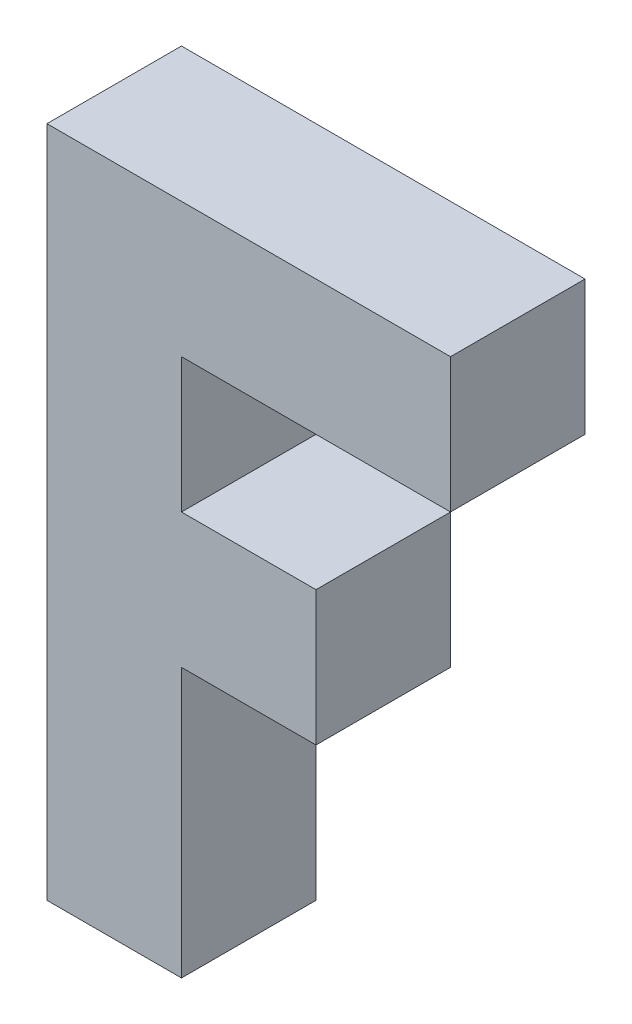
ISO-10303-21;
HEADER;
FILE_DESCRIPTION(('STEP AP214'),'2;1');
FILE_NAME('part.step','',(''),(''),'','','');
FILE_SCHEMA(('AUTOMOTIVE_DESIGN { 1 0 10303 214 1 1 1 1 }'));
ENDSEC;
DATA;
#1=APPLICATION_CONTEXT('core data for automotive mechanical design processes');
#2=APPLICATION_PROTOCOL_DEFINITION('international standard','automotive_design',2000,#1);
#3=PRODUCT_CONTEXT('',#1,'mechanical');
#4=PRODUCT('Part','Part','',(#3));
#5=PRODUCT_RELATED_PRODUCT_CATEGORY('part','',(#4));
#6=PRODUCT_DEFINITION_FORMATION('','',#4);
#7=PRODUCT_DEFINITION_CONTEXT('part definition',#1,'design');
#8=PRODUCT_DEFINITION('design','',#6,#7);
#9=PRODUCT_DEFINITION_SHAPE('','',#8);
#10=(LENGTH_UNIT() NAMED_UNIT(*) SI_UNIT(.MILLI.,.METRE.));
#11=(NAMED_UNIT(*) PLANE_ANGLE_UNIT() SI_UNIT($,.RADIAN.));
#12=(NAMED_UNIT(*) SI_UNIT($,.STERADIAN.) SOLID_ANGLE_UNIT());
#13=UNCERTAINTY_MEASURE_WITH_UNIT(LENGTH_MEASURE(1.E-05),#10,'distance_accuracy_value','');
#14=(GEOMETRIC_REPRESENTATION_CONTEXT(3) GLOBAL_UNCERTAINTY_ASSIGNED_CONTEXT((#13)) GLOBAL_UNIT_ASSIGNED_CONTEXT((#10,
#11,#12)) REPRESENTATION_CONTEXT('',''));
#15=CARTESIAN_POINT('',(0.,0.,0.));
#16=DIRECTION('',(0.,0.,1.));
#17=DIRECTION('',(1.,0.,0.));
#18=AXIS2_PLACEMENT_3D('',#15,#16,#17);
#19=CARTESIAN_POINT('',(0.,0.,10.));
#20=DIRECTION('',(1.,0.,0.));
#21=DIRECTION('',(0.,0.,-1.));
#22=AXIS2_PLACEMENT_3D('',#19,#20,#21);
#23=PLANE('',#22);
#24=DIRECTION('',(0.,-1.,0.));
#25=VECTOR('',#24,1.);
#26=CARTESIAN_POINT('',(0.,0.,0.));
#27=LINE('',#26,#25);
#28=CARTESIAN_POINT('',(0.,50.,0.));
#29=VERTEX_POINT('',#28);
#30=CARTESIAN_POINT('',(0.,0.,0.));
#31=VERTEX_POINT('',#30);
#32=EDGE_CURVE('E142',#29,#31,#27,.T.);
#33=ORIENTED_EDGE('',*,*,#32,.T.);
#34=DIRECTION('',(0.,0.,-1.));
#35=VECTOR('',#34,1.);
#36=CARTESIAN_POINT('',(0.,0.,10.));
#37=LINE('',#36,#35);
#38=CARTESIAN_POINT('',(0.,0.,10.));
#39=VERTEX_POINT('',#38);
#40=EDGE_CURVE('E11',#39,#31,#37,.T.);
#41=ORIENTED_EDGE('',*,*,#40,.F.);
#42=DIRECTION('',(0.,-1.,0.));
#43=VECTOR('',#42,1.);
#44=CARTESIAN_POINT('',(0.,0.,10.));
#45=LINE('',#44,#43);
#46=CARTESIAN_POINT('',(0.,50.,10.));
#47=VERTEX_POINT('',#46);
#48=EDGE_CURVE('E161',#47,#39,#45,.T.);
#49=ORIENTED_EDGE('',*,*,#48,.F.);
#50=DIRECTION('',(0.,0.,-1.));
#51=VECTOR('',#50,1.);
#52=CARTESIAN_POINT('',(0.,50.,10.));
#53=LINE('',#52,#51);
#54=EDGE_CURVE('E138',#47,#29,#53,.T.);
#55=ORIENTED_EDGE('',*,*,#54,.T.);
#56=EDGE_LOOP('',(#33,#41,#49,#55));
#57=FACE_BOUND('',#56,.T.);
#58=ADVANCED_FACE('F33',(#57),#23,.F.);
#59=CARTESIAN_POINT('',(0.,0.,10.));
#60=DIRECTION('',(0.,1.,0.));
#61=DIRECTION('',(0.,0.,1.));
#62=AXIS2_PLACEMENT_3D('',#59,#60,#61);
#63=PLANE('',#62);
#64=DIRECTION('',(1.,0.,0.));
#65=VECTOR('',#64,1.);
#66=CARTESIAN_POINT('',(0.,0.,0.));
#67=LINE('',#66,#65);
#68=CARTESIAN_POINT('',(10.,0.,0.));
#69=VERTEX_POINT('',#68);
#70=EDGE_CURVE('E145',#31,#69,#67,.T.);
#71=ORIENTED_EDGE('',*,*,#70,.T.);
#72=DIRECTION('',(0.,0.,-1.));
#73=VECTOR('',#72,1.);
#74=CARTESIAN_POINT('',(10.,0.,10.));
#75=LINE('',#74,#73);
#76=CARTESIAN_POINT('',(10.,0.,10.));
#77=VERTEX_POINT('',#76);
#78=EDGE_CURVE('E41',#77,#69,#75,.T.);
#79=ORIENTED_EDGE('',*,*,#78,.F.);
#80=DIRECTION('',(1.,0.,0.));
#81=VECTOR('',#80,1.);
#82=CARTESIAN_POINT('',(0.,0.,10.));
#83=LINE('',#82,#81);
#84=EDGE_CURVE('E96',#39,#77,#83,.T.);
#85=ORIENTED_EDGE('',*,*,#84,.F.);
#86=ORIENTED_EDGE('',*,*,#40,.T.);
#87=EDGE_LOOP('',(#71,#79,#85,#86));
#88=FACE_BOUND('',#87,.T.);
#89=ADVANCED_FACE('F208',(#88),#63,.F.);
#90=CARTESIAN_POINT('',(10.,0.,10.));
#91=DIRECTION('',(-1.,0.,0.));
#92=DIRECTION('',(0.,0.,1.));
#93=AXIS2_PLACEMENT_3D('',#90,#91,#92);
#94=PLANE('',#93);
#95=DIRECTION('',(0.,1.,0.));
#96=VECTOR('',#95,1.);
#97=CARTESIAN_POINT('',(10.,0.,0.));
#98=LINE('',#97,#96);
#99=CARTESIAN_POINT('',(10.,20.,0.));
#100=VERTEX_POINT('',#99);
#101=EDGE_CURVE('E147',#69,#100,#98,.T.);
#102=ORIENTED_EDGE('',*,*,#101,.T.);
#103=DIRECTION('',(0.,0.,-1.));
#104=VECTOR('',#103,1.);
#105=CARTESIAN_POINT('',(10.,20.,10.));
#106=LINE('',#105,#104);
#107=CARTESIAN_POINT('',(10.,20.,10.));
#108=VERTEX_POINT('',#107);
#109=EDGE_CURVE('E174',#108,#100,#106,.T.);
#110=ORIENTED_EDGE('',*,*,#109,.F.);
#111=DIRECTION('',(0.,1.,0.));
#112=VECTOR('',#111,1.);
#113=CARTESIAN_POINT('',(10.,0.,10.));
#114=LINE('',#113,#112);
#115=EDGE_CURVE('E182',#77,#108,#114,.T.);
#116=ORIENTED_EDGE('',*,*,#115,.F.);
#117=ORIENTED_EDGE('',*,*,#78,.T.);
#118=EDGE_LOOP('',(#102,#110,#116,#117));
#119=FACE_BOUND('',#118,.T.);
#120=ADVANCED_FACE('F180',(#119),#94,.F.);
#121=CARTESIAN_POINT('',(10.,20.,10.));
#122=DIRECTION('',(0.,1.,0.));
#123=DIRECTION('',(0.,0.,1.));
#124=AXIS2_PLACEMENT_3D('',#121,#122,#123);
#125=PLANE('',#124);
#126=DIRECTION('',(1.,0.,0.));
#127=VECTOR('',#126,1.);
#128=CARTESIAN_POINT('',(10.,20.,0.));
#129=LINE('',#128,#127);
#130=CARTESIAN_POINT('',(20.,20.,0.));
#131=VERTEX_POINT('',#130);
#132=EDGE_CURVE('E149',#100,#131,#129,.T.);
#133=ORIENTED_EDGE('',*,*,#132,.T.);
#134=DIRECTION('',(0.,0.,-1.));
#135=VECTOR('',#134,1.);
#136=CARTESIAN_POINT('',(20.,20.,10.));
#137=LINE('',#136,#135);
#138=CARTESIAN_POINT('',(20.,20.,10.));
#139=VERTEX_POINT('',#138);
#140=EDGE_CURVE('E171',#139,#131,#137,.T.);
#141=ORIENTED_EDGE('',*,*,#140,.F.);
#142=DIRECTION('',(1.,0.,0.));
#143=VECTOR('',#142,1.);
#144=CARTESIAN_POINT('',(10.,20.,10.));
#145=LINE('',#144,#143);
#146=EDGE_CURVE('E198',#108,#139,#145,.T.);
#147=ORIENTED_EDGE('',*,*,#146,.F.);
#148=ORIENTED_EDGE('',*,*,#109,.T.);
#149=EDGE_LOOP('',(#133,#141,#147,#148));
#150=FACE_BOUND('',#149,.T.);
#151=ADVANCED_FACE('F189',(#150),#125,.F.);
#152=CARTESIAN_POINT('',(20.,30.,10.));
#153=DIRECTION('',(-1.,0.,0.));
#154=DIRECTION('',(0.,0.,1.));
#155=AXIS2_PLACEMENT_3D('',#152,#153,#154);
#156=PLANE('',#155);
#157=DIRECTION('',(0.,1.,0.));
#158=VECTOR('',#157,1.);
#159=CARTESIAN_POINT('',(20.,30.,0.));
#160=LINE('',#159,#158);
#161=CARTESIAN_POINT('',(20.,30.,0.));
#162=VERTEX_POINT('',#161);
#163=EDGE_CURVE('E151',#131,#162,#160,.T.);
#164=ORIENTED_EDGE('',*,*,#163,.T.);
#165=DIRECTION('',(0.,0.,-1.));
#166=VECTOR('',#165,1.);
#167=CARTESIAN_POINT('',(20.,30.,10.));
#168=LINE('',#167,#166);
#169=CARTESIAN_POINT('',(20.,30.,10.));
#170=VERTEX_POINT('',#169);
#171=EDGE_CURVE('E168',#170,#162,#168,.T.);
#172=ORIENTED_EDGE('',*,*,#171,.F.);
#173=DIRECTION('',(0.,1.,0.));
#174=VECTOR('',#173,1.);
#175=CARTESIAN_POINT('',(20.,30.,10.));
#176=LINE('',#175,#174);
#177=EDGE_CURVE('E195',#139,#170,#176,.T.);
#178=ORIENTED_EDGE('',*,*,#177,.F.);
#179=ORIENTED_EDGE('',*,*,#140,.T.);
#180=EDGE_LOOP('',(#164,#172,#178,#179));
#181=FACE_BOUND('',#180,.T.);
#182=ADVANCED_FACE('F193',(#181),#156,.F.);
#183=CARTESIAN_POINT('',(10.,30.,10.));
#184=DIRECTION('',(0.,-1.,0.));
#185=DIRECTION('',(0.,0.,-1.));
#186=AXIS2_PLACEMENT_3D('',#183,#184,#185);
#187=PLANE('',#186);
#188=DIRECTION('',(-1.,0.,0.));
#189=VECTOR('',#188,1.);
#190=CARTESIAN_POINT('',(10.,30.,0.));
#191=LINE('',#190,#189);
#192=CARTESIAN_POINT('',(10.,30.,0.));
#193=VERTEX_POINT('',#192);
#194=EDGE_CURVE('E153',#162,#193,#191,.T.);
#195=ORIENTED_EDGE('',*,*,#194,.T.);
#196=DIRECTION('',(0.,0.,-1.));
#197=VECTOR('',#196,1.);
#198=CARTESIAN_POINT('',(10.,30.,10.));
#199=LINE('',#198,#197);
#200=CARTESIAN_POINT('',(10.,30.,10.));
#201=VERTEX_POINT('',#200);
#202=EDGE_CURVE('E165',#201,#193,#199,.T.);
#203=ORIENTED_EDGE('',*,*,#202,.F.);
#204=DIRECTION('',(-1.,0.,0.));
#205=VECTOR('',#204,1.);
#206=CARTESIAN_POINT('',(10.,30.,10.));
#207=LINE('',#206,#205);
#208=EDGE_CURVE('E197',#170,#201,#207,.T.);
#209=ORIENTED_EDGE('',*,*,#208,.F.);
#210=ORIENTED_EDGE('',*,*,#171,.T.);
#211=EDGE_LOOP('',(#195,#203,#209,#210));
#212=FACE_BOUND('',#211,.T.);
#213=ADVANCED_FACE('F220',(#212),#187,.F.);
#214=CARTESIAN_POINT('',(10.,30.,10.));
#215=DIRECTION('',(-1.,0.,0.));
#216=DIRECTION('',(0.,-1.,0.));
#217=AXIS2_PLACEMENT_3D('',#214,#215,#216);
#218=PLANE('',#217);
#219=DIRECTION('',(0.,1.,0.));
#220=VECTOR('',#219,1.);
#221=CARTESIAN_POINT('',(10.,30.,0.));
#222=LINE('',#221,#220);
#223=CARTESIAN_POINT('',(10.,40.,0.));
#224=VERTEX_POINT('',#223);
#225=EDGE_CURVE('E155',#193,#224,#222,.T.);
#226=ORIENTED_EDGE('',*,*,#225,.T.);
#227=DIRECTION('',(0.,0.,-1.));
#228=VECTOR('',#227,1.);
#229=CARTESIAN_POINT('',(10.,40.,10.));
#230=LINE('',#229,#228);
#231=CARTESIAN_POINT('',(10.,40.,10.));
#232=VERTEX_POINT('',#231);
#233=EDGE_CURVE('E133',#232,#224,#230,.T.);
#234=ORIENTED_EDGE('',*,*,#233,.F.);
#235=DIRECTION('',(0.,1.,0.));
#236=VECTOR('',#235,1.);
#237=CARTESIAN_POINT('',(10.,30.,10.));
#238=LINE('',#237,#236);
#239=EDGE_CURVE('E122',#201,#232,#238,.T.);
#240=ORIENTED_EDGE('',*,*,#239,.F.);
#241=ORIENTED_EDGE('',*,*,#202,.T.);
#242=EDGE_LOOP('',(#226,#234,#240,#241));
#243=FACE_BOUND('',#242,.T.);
#244=ADVANCED_FACE('F223',(#243),#218,.F.);
#245=CARTESIAN_POINT('',(10.,40.,10.));
#246=DIRECTION('',(0.,1.,0.));
#247=DIRECTION('',(0.,0.,1.));
#248=AXIS2_PLACEMENT_3D('',#245,#246,#247);
#249=PLANE('',#248);
#250=DIRECTION('',(1.,0.,0.));
#251=VECTOR('',#250,1.);
#252=CARTESIAN_POINT('',(10.,40.,0.));
#253=LINE('',#252,#251);
#254=CARTESIAN_POINT('',(30.,40.,0.));
#255=VERTEX_POINT('',#254);
#256=EDGE_CURVE('E131',#224,#255,#253,.T.);
#257=ORIENTED_EDGE('',*,*,#256,.T.);
#258=DIRECTION('',(0.,0.,-1.));
#259=VECTOR('',#258,1.);
#260=CARTESIAN_POINT('',(30.,40.,10.));
#261=LINE('',#260,#259);
#262=CARTESIAN_POINT('',(30.,40.,10.));
#263=VERTEX_POINT('',#262);
#264=EDGE_CURVE('E128',#263,#255,#261,.T.);
#265=ORIENTED_EDGE('',*,*,#264,.F.);
#266=DIRECTION('',(1.,0.,0.));
#267=VECTOR('',#266,1.);
#268=CARTESIAN_POINT('',(10.,40.,10.));
#269=LINE('',#268,#267);
#270=EDGE_CURVE('E115',#232,#263,#269,.T.);
#271=ORIENTED_EDGE('',*,*,#270,.F.);
#272=ORIENTED_EDGE('',*,*,#233,.T.);
#273=EDGE_LOOP('',(#257,#265,#271,#272));
#274=FACE_BOUND('',#273,.T.);
#275=ADVANCED_FACE('F129',(#274),#249,.F.);
#276=CARTESIAN_POINT('',(30.,50.,10.));
#277=DIRECTION('',(-1.,0.,0.));
#278=DIRECTION('',(0.,0.,1.));
#279=AXIS2_PLACEMENT_3D('',#276,#277,#278);
#280=PLANE('',#279);
#281=DIRECTION('',(0.,1.,0.));
#282=VECTOR('',#281,1.);
#283=CARTESIAN_POINT('',(30.,50.,0.));
#284=LINE('',#283,#282);
#285=CARTESIAN_POINT('',(30.,50.,0.));
#286=VERTEX_POINT('',#285);
#287=EDGE_CURVE('E158',#255,#286,#284,.T.);
#288=ORIENTED_EDGE('',*,*,#287,.T.);
#289=DIRECTION('',(0.,0.,-1.));
#290=VECTOR('',#289,1.);
#291=CARTESIAN_POINT('',(30.,50.,10.));
#292=LINE('',#291,#290);
#293=CARTESIAN_POINT('',(30.,50.,10.));
#294=VERTEX_POINT('',#293);
#295=EDGE_CURVE('E134',#294,#286,#292,.T.);
#296=ORIENTED_EDGE('',*,*,#295,.F.);
#297=DIRECTION('',(0.,1.,0.));
#298=VECTOR('',#297,1.);
#299=CARTESIAN_POINT('',(30.,50.,10.));
#300=LINE('',#299,#298);
#301=EDGE_CURVE('E119',#263,#294,#300,.T.);
#302=ORIENTED_EDGE('',*,*,#301,.F.);
#303=ORIENTED_EDGE('',*,*,#264,.T.);
#304=EDGE_LOOP('',(#288,#296,#302,#303));
#305=FACE_BOUND('',#304,.T.);
#306=ADVANCED_FACE('F136',(#305),#280,.F.);
#307=CARTESIAN_POINT('',(0.,50.,10.));
#308=DIRECTION('',(0.,-1.,0.));
#309=DIRECTION('',(0.,0.,-1.));
#310=AXIS2_PLACEMENT_3D('',#307,#308,#309);
#311=PLANE('',#310);
#312=DIRECTION('',(-1.,0.,0.));
#313=VECTOR('',#312,1.);
#314=CARTESIAN_POINT('',(0.,50.,0.));
#315=LINE('',#314,#313);
#316=EDGE_CURVE('E84',#286,#29,#315,.T.);
#317=ORIENTED_EDGE('',*,*,#316,.T.);
#318=ORIENTED_EDGE('',*,*,#54,.F.);
#319=DIRECTION('',(-1.,0.,0.));
#320=VECTOR('',#319,1.);
#321=CARTESIAN_POINT('',(10.,50.,10.));
#322=LINE('',#321,#320);
#323=EDGE_CURVE('E49',#294,#47,#322,.T.);
#324=ORIENTED_EDGE('',*,*,#323,.F.);
#325=ORIENTED_EDGE('',*,*,#295,.T.);
#326=EDGE_LOOP('',(#317,#318,#324,#325));
#327=FACE_BOUND('',#326,.T.);
#328=ADVANCED_FACE('F232',(#327),#311,.F.);
#329=CARTESIAN_POINT('',(0.,0.,10.));
#330=DIRECTION('',(0.,0.,-1.));
#331=DIRECTION('',(-1.,0.,0.));
#332=AXIS2_PLACEMENT_3D('',#329,#330,#331);
#333=PLANE('',#332);
#334=ORIENTED_EDGE('',*,*,#48,.T.);
#335=ORIENTED_EDGE('',*,*,#84,.T.);
#336=ORIENTED_EDGE('',*,*,#115,.T.);
#337=ORIENTED_EDGE('',*,*,#146,.T.);
#338=ORIENTED_EDGE('',*,*,#177,.T.);
#339=ORIENTED_EDGE('',*,*,#208,.T.);
#340=ORIENTED_EDGE('',*,*,#239,.T.);
#341=ORIENTED_EDGE('',*,*,#270,.T.);
#342=ORIENTED_EDGE('',*,*,#301,.T.);
#343=ORIENTED_EDGE('',*,*,#323,.T.);
#344=EDGE_LOOP('',(#334,#335,#336,#337,#338,#339,#340,#341,#342,#343));
#345=FACE_BOUND('',#344,.T.);
#346=ADVANCED_FACE('F117',(#345),#333,.F.);
#347=CARTESIAN_POINT('',(0.,0.,0.));
#348=DIRECTION('',(0.,0.,-1.));
#349=DIRECTION('',(-1.,0.,0.));
#350=AXIS2_PLACEMENT_3D('',#347,#348,#349);
#351=PLANE('',#350);
#352=ORIENTED_EDGE('',*,*,#32,.F.);
#353=ORIENTED_EDGE('',*,*,#316,.F.);
#354=ORIENTED_EDGE('',*,*,#287,.F.);
#355=ORIENTED_EDGE('',*,*,#256,.F.);
#356=ORIENTED_EDGE('',*,*,#225,.F.);
#357=ORIENTED_EDGE('',*,*,#194,.F.);
#358=ORIENTED_EDGE('',*,*,#163,.F.);
#359=ORIENTED_EDGE('',*,*,#132,.F.);
#360=ORIENTED_EDGE('',*,*,#101,.F.);
#361=ORIENTED_EDGE('',*,*,#70,.F.);
#362=EDGE_LOOP('',(#352,#353,#354,#355,#356,#357,#358,#359,#360,#361));
#363=FACE_BOUND('',#362,.T.);
#364=ADVANCED_FACE('F184',(#363),#351,.T.);
#365=CLOSED_SHELL('',(#58,#89,#120,#151,#182,#213,#244,#275,#306,#328,#346,#364));
#366=MANIFOLD_SOLID_BREP('B2',#365);
#367=ADVANCED_BREP_SHAPE_REPRESENTATION('',(#18,#366),#14);
#368=SHAPE_DEFINITION_REPRESENTATION(#9,#367);
ENDSEC;
END-ISO-10303-21;
